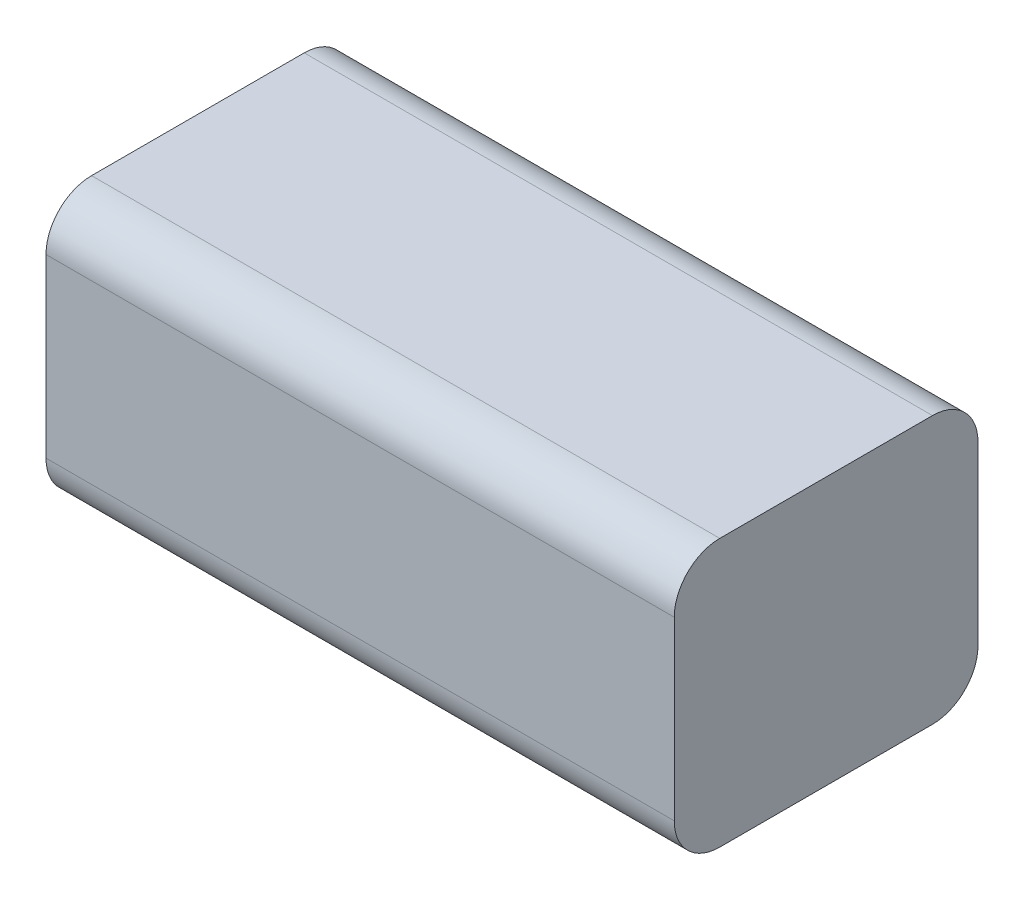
from build123d import *

# Parameters (mm, degrees)
SKETCH1_W           = 33.36
SKETCH1_H           = 29.37
BOSS_EXTRUDE1_DEPTH = 69
FILLET1_R           = 5
SCALE1_SCALE        = 0.7


with BuildPart() as part:
    # Sketch1 → Boss-Extrude1 (new body)
    with BuildSketch(Plane(origin=(0, 0, 0), x_dir=(0, 0, -1), z_dir=(1, 0, 0))):
        Rectangle(SKETCH1_W, SKETCH1_H)
    extrude(amount=BOSS_EXTRUDE1_DEPTH)

    # Fillet1
    fillet1_edges = [part.edges().sort_by_distance(p)[0] for p in [
        (34.5, -14.685, -16.68),
        (34.5, -14.685, 16.68),
        (34.5, 14.685, 16.68),
        (34.5, 14.685, -16.68),
    ]]
    fillet(fillet1_edges, radius=FILLET1_R)


with BuildPart() as part_1:
    # Scale1: scaled about (34.5, 0, 0)
    add(part.part.scale(SCALE1_SCALE).moved(Location((10.35, 0, 0))))


solid = part_1.part
